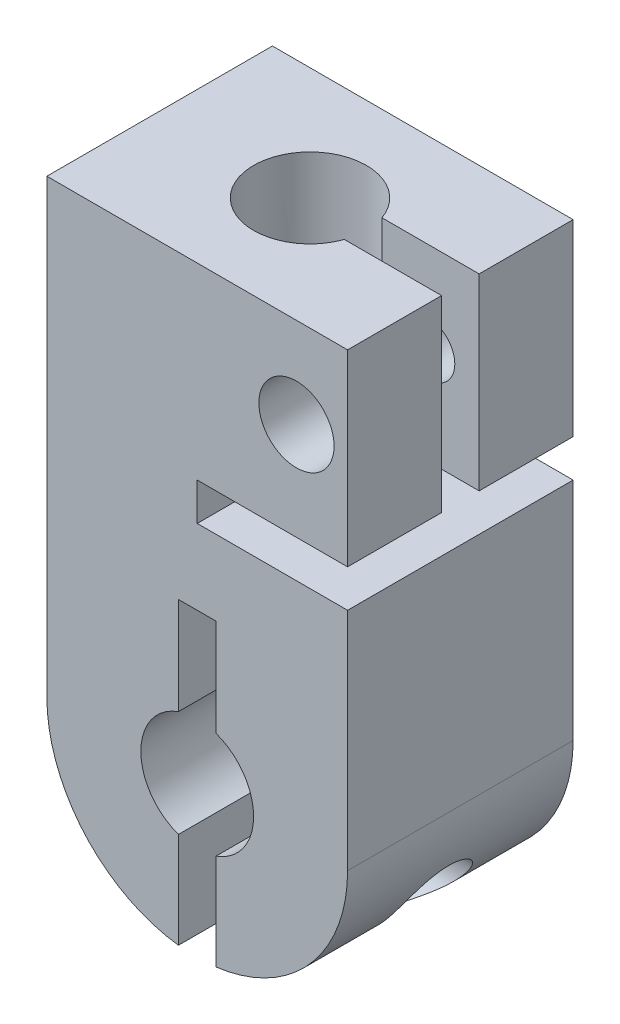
ISO-10303-21;
HEADER;
FILE_DESCRIPTION(('STEP AP214'),'2;1');
FILE_NAME('part.step','',(''),(''),'','','');
FILE_SCHEMA(('AUTOMOTIVE_DESIGN { 1 0 10303 214 1 1 1 1 }'));
ENDSEC;
DATA;
#1=APPLICATION_CONTEXT('core data for automotive mechanical design processes');
#2=APPLICATION_PROTOCOL_DEFINITION('international standard','automotive_design',2000,#1);
#3=PRODUCT_CONTEXT('',#1,'mechanical');
#4=PRODUCT('Part','Part','',(#3));
#5=PRODUCT_RELATED_PRODUCT_CATEGORY('part','',(#4));
#6=PRODUCT_DEFINITION_FORMATION('','',#4);
#7=PRODUCT_DEFINITION_CONTEXT('part definition',#1,'design');
#8=PRODUCT_DEFINITION('design','',#6,#7);
#9=PRODUCT_DEFINITION_SHAPE('','',#8);
#10=(LENGTH_UNIT() NAMED_UNIT(*) SI_UNIT(.MILLI.,.METRE.));
#11=(NAMED_UNIT(*) PLANE_ANGLE_UNIT() SI_UNIT($,.RADIAN.));
#12=(NAMED_UNIT(*) SI_UNIT($,.STERADIAN.) SOLID_ANGLE_UNIT());
#13=UNCERTAINTY_MEASURE_WITH_UNIT(LENGTH_MEASURE(1.E-05),#10,'distance_accuracy_value','');
#14=(GEOMETRIC_REPRESENTATION_CONTEXT(3) GLOBAL_UNCERTAINTY_ASSIGNED_CONTEXT((#13)) GLOBAL_UNIT_ASSIGNED_CONTEXT((#10,
#11,#12)) REPRESENTATION_CONTEXT('',''));
#15=CARTESIAN_POINT('',(0.,0.,0.));
#16=DIRECTION('',(0.,0.,1.));
#17=DIRECTION('',(1.,0.,0.));
#18=AXIS2_PLACEMENT_3D('',#15,#16,#17);
#19=CARTESIAN_POINT('',(6.35,19.05,9.525));
#20=DIRECTION('',(-1.,0.,0.));
#21=DIRECTION('',(0.,0.,1.));
#22=AXIS2_PLACEMENT_3D('',#19,#20,#21);
#23=PLANE('',#22);
#24=DIRECTION('',(0.,1.,0.));
#25=VECTOR('',#24,1.);
#26=CARTESIAN_POINT('',(6.35,9.525,3.96875));
#27=LINE('',#26,#25);
#28=CARTESIAN_POINT('',(6.35,11.1125,3.96875));
#29=VERTEX_POINT('',#28);
#30=CARTESIAN_POINT('',(6.35,19.05,3.96875));
#31=VERTEX_POINT('',#30);
#32=EDGE_CURVE('E56',#29,#31,#27,.T.);
#33=ORIENTED_EDGE('',*,*,#32,.F.);
#34=DIRECTION('',(0.,0.,-1.));
#35=VECTOR('',#34,1.);
#36=CARTESIAN_POINT('',(6.35,11.1125,9.525));
#37=LINE('',#36,#35);
#38=CARTESIAN_POINT('',(6.35,11.1125,0.));
#39=VERTEX_POINT('',#38);
#40=EDGE_CURVE('E398',#29,#39,#37,.T.);
#41=ORIENTED_EDGE('',*,*,#40,.T.);
#42=DIRECTION('',(0.,1.,0.));
#43=VECTOR('',#42,1.);
#44=CARTESIAN_POINT('',(6.35,19.05,0.));
#45=LINE('',#44,#43);
#46=CARTESIAN_POINT('',(6.35,19.05,0.));
#47=VERTEX_POINT('',#46);
#48=EDGE_CURVE('E222',#39,#47,#45,.T.);
#49=ORIENTED_EDGE('',*,*,#48,.T.);
#50=DIRECTION('',(0.,0.,-1.));
#51=VECTOR('',#50,1.);
#52=CARTESIAN_POINT('',(6.35,19.05,9.525));
#53=LINE('',#52,#51);
#54=EDGE_CURVE('E248',#31,#47,#53,.T.);
#55=ORIENTED_EDGE('',*,*,#54,.F.);
#56=EDGE_LOOP('',(#33,#41,#49,#55));
#57=FACE_BOUND('',#56,.T.);
#58=ADVANCED_FACE('F40',(#57),#23,.F.);
#59=DIRECTION('',(0.,1.,0.));
#60=VECTOR('',#59,1.);
#61=CARTESIAN_POINT('',(6.35,19.05,9.525));
#62=LINE('',#61,#60);
#63=CARTESIAN_POINT('',(6.35,11.1125,9.525));
#64=VERTEX_POINT('',#63);
#65=CARTESIAN_POINT('',(6.35,19.05,9.525));
#66=VERTEX_POINT('',#65);
#67=EDGE_CURVE('E235',#64,#66,#62,.T.);
#68=ORIENTED_EDGE('',*,*,#67,.F.);
#69=CARTESIAN_POINT('',(6.35,11.1125,5.55625));
#70=VERTEX_POINT('',#69);
#71=EDGE_CURVE('E376',#64,#70,#37,.T.);
#72=ORIENTED_EDGE('',*,*,#71,.T.);
#73=DIRECTION('',(0.,1.,0.));
#74=VECTOR('',#73,1.);
#75=CARTESIAN_POINT('',(6.35,9.525,5.55625));
#76=LINE('',#75,#74);
#77=CARTESIAN_POINT('',(6.35,19.05,5.55625));
#78=VERTEX_POINT('',#77);
#79=EDGE_CURVE('E423',#70,#78,#76,.T.);
#80=ORIENTED_EDGE('',*,*,#79,.T.);
#81=EDGE_CURVE('E249',#66,#78,#53,.T.);
#82=ORIENTED_EDGE('',*,*,#81,.F.);
#83=EDGE_LOOP('',(#68,#72,#80,#82));
#84=FACE_BOUND('',#83,.T.);
#85=ADVANCED_FACE('F358',(#84),#23,.F.);
#86=CARTESIAN_POINT('',(0.,0.,9.525));
#87=DIRECTION('',(0.,0.,-1.));
#88=DIRECTION('',(-1.,0.,0.));
#89=AXIS2_PLACEMENT_3D('',#86,#87,#88);
#90=CYLINDRICAL_SURFACE('',#89,6.35);
#91=CARTESIAN_POINT('',(-4.87918066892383,-4.064,3.63220000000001));
#92=CARTESIAN_POINT('',(-4.94061964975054,-3.99023319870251,3.63219971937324));
#93=CARTESIAN_POINT('',(-5.00044819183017,-3.91497650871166,3.63941180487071));
#94=CARTESIAN_POINT('',(-5.11515878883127,-3.76385774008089,3.67006060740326));
#95=CARTESIAN_POINT('',(-5.17004164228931,-3.68799576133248,3.69349469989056));
#96=CARTESIAN_POINT('',(-5.26010445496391,-3.55786831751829,3.7500251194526));
#97=CARTESIAN_POINT('',(-5.29677781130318,-3.50294962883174,3.77923533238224));
#98=CARTESIAN_POINT('',(-5.36549033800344,-3.39676325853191,3.84797038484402));
#99=CARTESIAN_POINT('',(-5.39753288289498,-3.34549293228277,3.88748765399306));
#100=CARTESIAN_POINT('',(-5.45641726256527,-3.24857762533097,3.97697838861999));
#101=CARTESIAN_POINT('',(-5.48321947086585,-3.20297638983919,4.02702599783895));
#102=CARTESIAN_POINT('',(-5.5305987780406,-3.12045682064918,4.13641200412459));
#103=CARTESIAN_POINT('',(-5.55117951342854,-3.08353341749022,4.19574494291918));
#104=CARTESIAN_POINT('',(-5.58342827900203,-3.02470096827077,4.3139055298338));
#105=CARTESIAN_POINT('',(-5.5958879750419,-3.00149335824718,4.37187248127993));
#106=CARTESIAN_POINT('',(-5.6153933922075,-2.96484304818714,4.49167239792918));
#107=CARTESIAN_POINT('',(-5.62244235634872,-2.95139449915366,4.55350302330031));
#108=CARTESIAN_POINT('',(-5.63063397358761,-2.93573333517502,4.67344734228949));
#109=CARTESIAN_POINT('',(-5.63223647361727,-2.93264621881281,4.73141738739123));
#110=CARTESIAN_POINT('',(-5.63080872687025,-2.93538691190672,4.84708131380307));
#111=CARTESIAN_POINT('',(-5.62777961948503,-2.94121252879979,4.9047752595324));
#112=CARTESIAN_POINT('',(-5.61726390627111,-2.96124427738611,5.01679972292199));
#113=CARTESIAN_POINT('',(-5.60988719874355,-2.97524371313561,5.0711778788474));
#114=CARTESIAN_POINT('',(-5.59087538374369,-3.01081655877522,5.17659910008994));
#115=CARTESIAN_POINT('',(-5.57924014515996,-3.0323902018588,5.22764206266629));
#116=CARTESIAN_POINT('',(-5.55154170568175,-3.08281181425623,5.32641506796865));
#117=CARTESIAN_POINT('',(-5.535373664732,-3.11183043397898,5.37402822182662));
#118=CARTESIAN_POINT('',(-5.49902099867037,-3.17562806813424,5.46349581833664));
#119=CARTESIAN_POINT('',(-5.47883543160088,-3.21040843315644,5.5053489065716));
#120=CARTESIAN_POINT('',(-5.43313987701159,-3.28719146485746,5.58557697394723));
#121=CARTESIAN_POINT('',(-5.40734440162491,-3.32953990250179,5.62345694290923));
#122=CARTESIAN_POINT('',(-5.35200401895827,-3.41778709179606,5.69153032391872));
#123=CARTESIAN_POINT('',(-5.32245764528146,-3.46368722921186,5.72172071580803));
#124=CARTESIAN_POINT('',(-5.25609651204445,-3.56370512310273,5.7778738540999));
#125=CARTESIAN_POINT('',(-5.21883602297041,-3.61811705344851,5.80278199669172));
#126=CARTESIAN_POINT('',(-5.14094396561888,-3.72796752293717,5.84328392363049));
#127=CARTESIAN_POINT('',(-5.10031018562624,-3.78340671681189,5.85887154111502));
#128=CARTESIAN_POINT('',(-5.00872183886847,-3.90409143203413,5.88341874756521));
#129=CARTESIAN_POINT('',(-4.95723596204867,-3.96928274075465,5.89065263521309));
#130=CARTESIAN_POINT('',(-4.85161566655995,-4.09771358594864,5.89412410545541));
#131=CARTESIAN_POINT('',(-4.79748072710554,-4.16095273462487,5.89035951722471));
#132=CARTESIAN_POINT('',(-4.67605008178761,-4.29732758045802,5.87102076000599));
#133=CARTESIAN_POINT('',(-4.60835918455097,-4.36978551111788,5.85315290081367));
#134=CARTESIAN_POINT('',(-4.47189588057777,-4.50934552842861,5.80400905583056));
#135=CARTESIAN_POINT('',(-4.40312085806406,-4.5764310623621,5.772693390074));
#136=CARTESIAN_POINT('',(-4.29535937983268,-4.67710684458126,5.71303476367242));
#137=CARTESIAN_POINT('',(-4.25601454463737,-4.71291414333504,5.68898476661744));
#138=CARTESIAN_POINT('',(-4.17810191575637,-4.78212032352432,5.63643994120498));
#139=CARTESIAN_POINT('',(-4.13953458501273,-4.81551779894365,5.60794254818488));
#140=CARTESIAN_POINT('',(-4.06398051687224,-4.87944687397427,5.54645430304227));
#141=CARTESIAN_POINT('',(-4.026987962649,-4.90998963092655,5.51348229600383));
#142=CARTESIAN_POINT('',(-3.95531889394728,-4.96790373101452,5.44266605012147));
#143=CARTESIAN_POINT('',(-3.92063915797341,-4.99527952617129,5.40482881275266));
#144=CARTESIAN_POINT('',(-3.8592817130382,-5.04279111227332,5.32929664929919));
#145=CARTESIAN_POINT('',(-3.83215582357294,-5.06340537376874,5.29227250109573));
#146=CARTESIAN_POINT('',(-3.7818112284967,-5.10111654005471,5.21399752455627));
#147=CARTESIAN_POINT('',(-3.75858787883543,-5.11821763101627,5.1727518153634));
#148=CARTESIAN_POINT('',(-3.72086570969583,-5.14568941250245,5.09269646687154));
#149=CARTESIAN_POINT('',(-3.70557489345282,-5.156690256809,5.05448457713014));
#150=CARTESIAN_POINT('',(-3.68025293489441,-5.17479304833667,4.97546462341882));
#151=CARTESIAN_POINT('',(-3.67021597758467,-5.18189930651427,4.93465948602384));
#152=CARTESIAN_POINT('',(-3.65645953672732,-5.19161629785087,4.85105509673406));
#153=CARTESIAN_POINT('',(-3.65279678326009,-5.19418666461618,4.80824138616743));
#154=CARTESIAN_POINT('',(-3.65248526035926,-5.19440584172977,4.72257934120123));
#155=CARTESIAN_POINT('',(-3.65583491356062,-5.19205575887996,4.67973101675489));
#156=CARTESIAN_POINT('',(-3.66815819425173,-5.18335401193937,4.60135749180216));
#157=CARTESIAN_POINT('',(-3.67630568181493,-5.17758955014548,4.56562842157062));
#158=CARTESIAN_POINT('',(-3.69674076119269,-5.16301904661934,4.49604063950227));
#159=CARTESIAN_POINT('',(-3.70903038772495,-5.15421151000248,4.46218285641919));
#160=CARTESIAN_POINT('',(-3.74458191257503,-5.12848007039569,4.37873338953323));
#161=CARTESIAN_POINT('',(-3.77016550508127,-5.10975363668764,4.33069131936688));
#162=CARTESIAN_POINT('',(-3.82665035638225,-5.06759320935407,4.24011272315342));
#163=CARTESIAN_POINT('',(-3.85756657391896,-5.04414594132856,4.19759229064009));
#164=CARTESIAN_POINT('',(-3.94140679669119,-4.97915392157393,4.09497829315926));
#165=CARTESIAN_POINT('',(-3.99683992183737,-4.93490551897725,4.03866106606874));
#166=CARTESIAN_POINT('',(-4.11186542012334,-4.83949461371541,3.93724921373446));
#167=CARTESIAN_POINT('',(-4.17146797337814,-4.78831488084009,3.89218337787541));
#168=CARTESIAN_POINT('',(-4.31021917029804,-4.66427941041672,3.80083557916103));
#169=CARTESIAN_POINT('',(-4.38996341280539,-4.58947423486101,3.75808999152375));
#170=CARTESIAN_POINT('',(-4.54885817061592,-4.43202613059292,3.69038174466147));
#171=CARTESIAN_POINT('',(-4.62800972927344,-4.34940608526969,3.66536888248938));
#172=CARTESIAN_POINT('',(-4.73504274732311,-4.23128936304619,3.64416223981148));
#173=CARTESIAN_POINT('',(-4.76426427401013,-4.19836075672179,3.63971658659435));
#174=CARTESIAN_POINT('',(-4.82216522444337,-4.13172744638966,3.63373445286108));
#175=CARTESIAN_POINT('',(-4.85084423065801,-4.09802218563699,3.63220012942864));
#176=CARTESIAN_POINT('',(-4.87918066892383,-4.064,3.63220000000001));
#177=B_SPLINE_CURVE_WITH_KNOTS('',3,(#91,#92,#93,#94,#95,#96,#97,#98,#99,#100,#101,#102,#103,
#104,#105,#106,#107,#108,#109,#110,#111,#112,#113,#114,#115,#116,#117,#118,#119,#120,#121,#122,
#123,#124,#125,#126,#127,#128,#129,#130,#131,#132,#133,#134,#135,#136,#137,#138,#139,#140,#141,
#142,#143,#144,#145,#146,#147,#148,#149,#150,#151,#152,#153,#154,#155,#156,#157,#158,#159,#160,
#161,#162,#163,#164,#165,#166,#167,#168,#169,#170,#171,#172,#173,#174,#175,#176),.UNSPECIFIED.,
.T.,.F.,(4,2,2,2,2,2,2,2,2,2,2,2,2,2,2,2,2,2,2,2,2,2,2,2,2,2,2,2,2,2,2,2,2,2,2,2,2,2,2,2,2,2,4),
(0.,0.287847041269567,0.575647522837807,0.791418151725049,1.0070307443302,1.22421554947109,
1.44127316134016,1.63124738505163,1.82110765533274,1.99447638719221,2.16780247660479,
2.33692455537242,2.50605184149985,2.67946951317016,2.85292789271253,3.03937302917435,
3.22589128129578,3.43657639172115,3.64740074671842,3.89664783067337,4.14594411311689,
4.44709812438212,4.74914691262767,4.92410997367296,5.09917430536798,5.27352298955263,
5.44762352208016,5.59821346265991,5.74862291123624,5.87594679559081,6.00312945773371,
6.13143835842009,6.2597184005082,6.37056562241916,6.48146737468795,6.65316488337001,
6.82535210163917,7.09556407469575,7.36646052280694,7.7169855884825,8.06651427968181,
8.19917473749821,8.33193344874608),.UNSPECIFIED.);
#178=CARTESIAN_POINT('',(-4.87918066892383,-4.064,3.63220000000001));
#179=VERTEX_POINT('',#178);
#180=EDGE_CURVE('E309',#179,#179,#177,.T.);
#181=ORIENTED_EDGE('',*,*,#180,.T.);
#182=EDGE_LOOP('',(#181));
#183=FACE_BOUND('',#182,.T.);
#184=CARTESIAN_POINT('',(0.,0.,0.));
#185=DIRECTION('',(0.,0.,1.));
#186=DIRECTION('',(1.,0.,0.));
#187=AXIS2_PLACEMENT_3D('',#184,#185,#186);
#188=CIRCLE('',#187,6.35);
#189=CARTESIAN_POINT('',(-6.35,0.,0.));
#190=VERTEX_POINT('',#189);
#191=CARTESIAN_POINT('',(-0.793750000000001,-6.30019530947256,0.));
#192=VERTEX_POINT('',#191);
#193=EDGE_CURVE('E226',#190,#192,#188,.T.);
#194=ORIENTED_EDGE('',*,*,#193,.T.);
#195=DIRECTION('',(0.,0.,-1.));
#196=VECTOR('',#195,1.);
#197=CARTESIAN_POINT('',(-0.793750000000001,-6.30019530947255,9.525));
#198=LINE('',#197,#196);
#199=CARTESIAN_POINT('',(-0.793750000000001,-6.30019530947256,9.525));
#200=VERTEX_POINT('',#199);
#201=EDGE_CURVE('E286',#192,#200,#198,.F.);
#202=ORIENTED_EDGE('',*,*,#201,.T.);
#203=CARTESIAN_POINT('',(0.,0.,9.525));
#204=DIRECTION('',(0.,0.,1.));
#205=DIRECTION('',(1.,0.,0.));
#206=AXIS2_PLACEMENT_3D('',#203,#204,#205);
#207=CIRCLE('',#206,6.35);
#208=CARTESIAN_POINT('',(-6.35,0.,9.525));
#209=VERTEX_POINT('',#208);
#210=EDGE_CURVE('E232',#209,#200,#207,.T.);
#211=ORIENTED_EDGE('',*,*,#210,.F.);
#212=DIRECTION('',(0.,0.,-1.));
#213=VECTOR('',#212,1.);
#214=CARTESIAN_POINT('',(-6.35,0.,9.525));
#215=LINE('',#214,#213);
#216=EDGE_CURVE('E242',#209,#190,#215,.T.);
#217=ORIENTED_EDGE('',*,*,#216,.T.);
#218=EDGE_LOOP('',(#194,#202,#211,#217));
#219=FACE_BOUND('',#218,.T.);
#220=ADVANCED_FACE('F365',(#183,#219),#90,.T.);
#221=CARTESIAN_POINT('',(0.,0.,9.525));
#222=DIRECTION('',(0.,0.,-1.));
#223=DIRECTION('',(-1.,0.,0.));
#224=AXIS2_PLACEMENT_3D('',#221,#222,#223);
#225=CYLINDRICAL_SURFACE('',#224,2.38125);
#226=DIRECTION('',(0.,0.,-1.));
#227=VECTOR('',#226,1.);
#228=CARTESIAN_POINT('',(-0.793750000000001,2.24506403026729,9.525));
#229=LINE('',#228,#227);
#230=CARTESIAN_POINT('',(-0.793750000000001,2.24506403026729,9.525));
#231=VERTEX_POINT('',#230);
#232=CARTESIAN_POINT('',(-0.793750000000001,2.24506403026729,0.));
#233=VERTEX_POINT('',#232);
#234=EDGE_CURVE('E50',#231,#233,#229,.T.);
#235=ORIENTED_EDGE('',*,*,#234,.F.);
#236=CARTESIAN_POINT('',(0.,0.,9.525));
#237=DIRECTION('',(0.,0.,1.));
#238=DIRECTION('',(1.,0.,0.));
#239=AXIS2_PLACEMENT_3D('',#236,#237,#238);
#240=CIRCLE('',#239,2.38125);
#241=CARTESIAN_POINT('',(-0.793750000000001,-2.24506403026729,9.525));
#242=VERTEX_POINT('',#241);
#243=EDGE_CURVE('E284',#231,#242,#240,.T.);
#244=ORIENTED_EDGE('',*,*,#243,.T.);
#245=DIRECTION('',(0.,0.,-1.));
#246=VECTOR('',#245,1.);
#247=CARTESIAN_POINT('',(-0.793750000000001,-2.24506403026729,9.525));
#248=LINE('',#247,#246);
#249=CARTESIAN_POINT('',(-0.793750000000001,-2.24506403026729,0.));
#250=VERTEX_POINT('',#249);
#251=EDGE_CURVE('E257',#250,#242,#248,.F.);
#252=ORIENTED_EDGE('',*,*,#251,.F.);
#253=CARTESIAN_POINT('',(0.,0.,0.));
#254=DIRECTION('',(0.,0.,1.));
#255=DIRECTION('',(1.,0.,0.));
#256=AXIS2_PLACEMENT_3D('',#253,#254,#255);
#257=CIRCLE('',#256,2.38125);
#258=EDGE_CURVE('E273',#233,#250,#257,.T.);
#259=ORIENTED_EDGE('',*,*,#258,.F.);
#260=EDGE_LOOP('',(#235,#244,#252,#259));
#261=FACE_BOUND('',#260,.T.);
#262=ADVANCED_FACE('F279',(#261),#225,.F.);
#263=CARTESIAN_POINT('',(0.,0.,9.525));
#264=DIRECTION('',(0.,0.,1.));
#265=DIRECTION('',(1.,0.,0.));
#266=AXIS2_PLACEMENT_3D('',#263,#264,#265);
#267=PLANE('',#266);
#268=CARTESIAN_POINT('',(4.191,15.24,9.525));
#269=DIRECTION('',(0.,0.,1.));
#270=DIRECTION('',(1.,0.,0.));
#271=AXIS2_PLACEMENT_3D('',#268,#269,#270);
#272=CIRCLE('',#271,1.5875);
#273=CARTESIAN_POINT('',(5.7785,15.24,9.525));
#274=VERTEX_POINT('',#273);
#275=EDGE_CURVE('E479',#274,#274,#272,.T.);
#276=ORIENTED_EDGE('',*,*,#275,.F.);
#277=EDGE_LOOP('',(#276));
#278=FACE_BOUND('',#277,.T.);
#279=DIRECTION('',(1.,0.,0.));
#280=VECTOR('',#279,1.);
#281=CARTESIAN_POINT('',(6.35,11.1125,9.525));
#282=LINE('',#281,#280);
#283=CARTESIAN_POINT('',(0.,11.1125,9.525));
#284=VERTEX_POINT('',#283);
#285=EDGE_CURVE('E384',#284,#64,#282,.T.);
#286=ORIENTED_EDGE('',*,*,#285,.T.);
#287=ORIENTED_EDGE('',*,*,#67,.T.);
#288=DIRECTION('',(-1.,0.,0.));
#289=VECTOR('',#288,1.);
#290=CARTESIAN_POINT('',(-6.35,19.05,9.525));
#291=LINE('',#290,#289);
#292=CARTESIAN_POINT('',(-6.35,19.05,9.525));
#293=VERTEX_POINT('',#292);
#294=EDGE_CURVE('E238',#66,#293,#291,.T.);
#295=ORIENTED_EDGE('',*,*,#294,.T.);
#296=DIRECTION('',(0.,-1.,0.));
#297=VECTOR('',#296,1.);
#298=CARTESIAN_POINT('',(-6.35,0.,9.525));
#299=LINE('',#298,#297);
#300=EDGE_CURVE('E240',#293,#209,#299,.T.);
#301=ORIENTED_EDGE('',*,*,#300,.T.);
#302=ORIENTED_EDGE('',*,*,#210,.T.);
#303=DIRECTION('',(0.,-1.,0.));
#304=VECTOR('',#303,1.);
#305=CARTESIAN_POINT('',(-0.793750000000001,6.35,9.525));
#306=LINE('',#305,#304);
#307=EDGE_CURVE('E308',#242,#200,#306,.T.);
#308=ORIENTED_EDGE('',*,*,#307,.F.);
#309=ORIENTED_EDGE('',*,*,#243,.F.);
#310=CARTESIAN_POINT('',(-0.793750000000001,6.35,9.525));
#311=VERTEX_POINT('',#310);
#312=EDGE_CURVE('E267',#311,#231,#306,.T.);
#313=ORIENTED_EDGE('',*,*,#312,.F.);
#314=DIRECTION('',(-1.,0.,0.));
#315=VECTOR('',#314,1.);
#316=CARTESIAN_POINT('',(-0.793750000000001,6.35,9.525));
#317=LINE('',#316,#315);
#318=CARTESIAN_POINT('',(0.793749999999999,6.35,9.525));
#319=VERTEX_POINT('',#318);
#320=EDGE_CURVE('E301',#319,#311,#317,.T.);
#321=ORIENTED_EDGE('',*,*,#320,.F.);
#322=DIRECTION('',(0.,1.,0.));
#323=VECTOR('',#322,1.);
#324=CARTESIAN_POINT('',(0.793749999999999,6.35,9.525));
#325=LINE('',#324,#323);
#326=CARTESIAN_POINT('',(0.79375,2.24506403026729,9.525));
#327=VERTEX_POINT('',#326);
#328=EDGE_CURVE('E305',#327,#319,#325,.T.);
#329=ORIENTED_EDGE('',*,*,#328,.F.);
#330=CARTESIAN_POINT('',(0.79375,-2.24506403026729,9.525));
#331=VERTEX_POINT('',#330);
#332=EDGE_CURVE('E280',#331,#327,#240,.T.);
#333=ORIENTED_EDGE('',*,*,#332,.F.);
#334=CARTESIAN_POINT('',(0.79375,-6.30019530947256,9.525));
#335=VERTEX_POINT('',#334);
#336=EDGE_CURVE('E304',#335,#331,#325,.T.);
#337=ORIENTED_EDGE('',*,*,#336,.F.);
#338=CARTESIAN_POINT('',(6.35,0.,9.525));
#339=VERTEX_POINT('',#338);
#340=EDGE_CURVE('E231',#335,#339,#207,.T.);
#341=ORIENTED_EDGE('',*,*,#340,.T.);
#342=CARTESIAN_POINT('',(6.35,9.525,9.525));
#343=VERTEX_POINT('',#342);
#344=EDGE_CURVE('E236',#339,#343,#62,.T.);
#345=ORIENTED_EDGE('',*,*,#344,.T.);
#346=DIRECTION('',(-1.,0.,0.));
#347=VECTOR('',#346,1.);
#348=CARTESIAN_POINT('',(6.35,9.525,9.525));
#349=LINE('',#348,#347);
#350=CARTESIAN_POINT('',(0.,9.525,9.525));
#351=VERTEX_POINT('',#350);
#352=EDGE_CURVE('E199',#343,#351,#349,.T.);
#353=ORIENTED_EDGE('',*,*,#352,.T.);
#354=DIRECTION('',(0.,1.,0.));
#355=VECTOR('',#354,1.);
#356=CARTESIAN_POINT('',(0.,9.525,9.525));
#357=LINE('',#356,#355);
#358=EDGE_CURVE('E386',#351,#284,#357,.T.);
#359=ORIENTED_EDGE('',*,*,#358,.T.);
#360=EDGE_LOOP('',(#286,#287,#295,#301,#302,#308,#309,#313,#321,#329,#333,#337,#341,#345,#353,#359));
#361=FACE_BOUND('',#360,.T.);
#362=ADVANCED_FACE('F346',(#278,#361),#267,.T.);
#363=CARTESIAN_POINT('',(0.,0.,0.));
#364=DIRECTION('',(0.,0.,1.));
#365=DIRECTION('',(1.,0.,0.));
#366=AXIS2_PLACEMENT_3D('',#363,#364,#365);
#367=PLANE('',#366);
#368=CARTESIAN_POINT('',(4.191,15.24,0.));
#369=DIRECTION('',(0.,0.,1.));
#370=DIRECTION('',(1.,0.,0.));
#371=AXIS2_PLACEMENT_3D('',#368,#369,#370);
#372=CIRCLE('',#371,1.1303);
#373=CARTESIAN_POINT('',(5.3213,15.24,0.));
#374=VERTEX_POINT('',#373);
#375=EDGE_CURVE('E473',#374,#374,#372,.T.);
#376=ORIENTED_EDGE('',*,*,#375,.T.);
#377=EDGE_LOOP('',(#376));
#378=FACE_BOUND('',#377,.T.);
#379=ORIENTED_EDGE('',*,*,#48,.F.);
#380=DIRECTION('',(1.,0.,0.));
#381=VECTOR('',#380,1.);
#382=CARTESIAN_POINT('',(6.35,11.1125,0.));
#383=LINE('',#382,#381);
#384=CARTESIAN_POINT('',(0.,11.1125,0.));
#385=VERTEX_POINT('',#384);
#386=EDGE_CURVE('E459',#385,#39,#383,.T.);
#387=ORIENTED_EDGE('',*,*,#386,.F.);
#388=DIRECTION('',(0.,1.,0.));
#389=VECTOR('',#388,1.);
#390=CARTESIAN_POINT('',(0.,9.525,0.));
#391=LINE('',#390,#389);
#392=CARTESIAN_POINT('',(0.,9.525,0.));
#393=VERTEX_POINT('',#392);
#394=EDGE_CURVE('E216',#393,#385,#391,.T.);
#395=ORIENTED_EDGE('',*,*,#394,.F.);
#396=DIRECTION('',(-1.,0.,0.));
#397=VECTOR('',#396,1.);
#398=CARTESIAN_POINT('',(6.35,9.525,0.));
#399=LINE('',#398,#397);
#400=CARTESIAN_POINT('',(6.35,9.525,0.));
#401=VERTEX_POINT('',#400);
#402=EDGE_CURVE('E196',#401,#393,#399,.T.);
#403=ORIENTED_EDGE('',*,*,#402,.F.);
#404=CARTESIAN_POINT('',(6.35,0.,0.));
#405=VERTEX_POINT('',#404);
#406=EDGE_CURVE('E212',#405,#401,#45,.T.);
#407=ORIENTED_EDGE('',*,*,#406,.F.);
#408=CARTESIAN_POINT('',(0.79375,-6.30019530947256,0.));
#409=VERTEX_POINT('',#408);
#410=EDGE_CURVE('E447',#409,#405,#188,.T.);
#411=ORIENTED_EDGE('',*,*,#410,.F.);
#412=DIRECTION('',(0.,1.,0.));
#413=VECTOR('',#412,1.);
#414=CARTESIAN_POINT('',(0.793749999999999,6.35,0.));
#415=LINE('',#414,#413);
#416=CARTESIAN_POINT('',(0.79375,-2.24506403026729,0.));
#417=VERTEX_POINT('',#416);
#418=EDGE_CURVE('E299',#409,#417,#415,.T.);
#419=ORIENTED_EDGE('',*,*,#418,.T.);
#420=CARTESIAN_POINT('',(0.79375,2.24506403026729,0.));
#421=VERTEX_POINT('',#420);
#422=EDGE_CURVE('E281',#417,#421,#257,.T.);
#423=ORIENTED_EDGE('',*,*,#422,.T.);
#424=CARTESIAN_POINT('',(0.793749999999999,6.35,0.));
#425=VERTEX_POINT('',#424);
#426=EDGE_CURVE('E277',#421,#425,#415,.T.);
#427=ORIENTED_EDGE('',*,*,#426,.T.);
#428=DIRECTION('',(-1.,0.,0.));
#429=VECTOR('',#428,1.);
#430=CARTESIAN_POINT('',(-0.793750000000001,6.35,0.));
#431=LINE('',#430,#429);
#432=CARTESIAN_POINT('',(-0.793750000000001,6.35,0.));
#433=VERTEX_POINT('',#432);
#434=EDGE_CURVE('E276',#425,#433,#431,.T.);
#435=ORIENTED_EDGE('',*,*,#434,.T.);
#436=DIRECTION('',(0.,-1.,0.));
#437=VECTOR('',#436,1.);
#438=CARTESIAN_POINT('',(-0.793750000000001,6.35,0.));
#439=LINE('',#438,#437);
#440=EDGE_CURVE('E264',#433,#233,#439,.T.);
#441=ORIENTED_EDGE('',*,*,#440,.T.);
#442=ORIENTED_EDGE('',*,*,#258,.T.);
#443=EDGE_CURVE('E64',#250,#192,#439,.T.);
#444=ORIENTED_EDGE('',*,*,#443,.T.);
#445=ORIENTED_EDGE('',*,*,#193,.F.);
#446=DIRECTION('',(0.,-1.,0.));
#447=VECTOR('',#446,1.);
#448=CARTESIAN_POINT('',(-6.35,0.,0.));
#449=LINE('',#448,#447);
#450=CARTESIAN_POINT('',(-6.35,19.05,0.));
#451=VERTEX_POINT('',#450);
#452=EDGE_CURVE('E224',#451,#190,#449,.T.);
#453=ORIENTED_EDGE('',*,*,#452,.F.);
#454=DIRECTION('',(-1.,0.,0.));
#455=VECTOR('',#454,1.);
#456=CARTESIAN_POINT('',(-6.35,19.05,0.));
#457=LINE('',#456,#455);
#458=EDGE_CURVE('E221',#47,#451,#457,.T.);
#459=ORIENTED_EDGE('',*,*,#458,.F.);
#460=EDGE_LOOP('',(#379,#387,#395,#403,#407,#411,#419,#423,#427,#435,#441,#442,#444,#445,#453,#459));
#461=FACE_BOUND('',#460,.T.);
#462=ADVANCED_FACE('F210',(#378,#461),#367,.F.);
#463=CARTESIAN_POINT('',(4.87918066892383,-4.064,6.39444999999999));
#464=CARTESIAN_POINT('',(4.96825384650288,-3.95705720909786,6.39444975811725));
#465=CARTESIAN_POINT('',(5.05383740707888,-3.8471027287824,6.38395977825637));
#466=CARTESIAN_POINT('',(5.21530580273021,-3.6251591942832,6.33839085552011));
#467=CARTESIAN_POINT('',(5.29121104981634,-3.51317501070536,6.30336470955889));
#468=CARTESIAN_POINT('',(5.41040440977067,-3.32544999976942,6.22026268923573));
#469=CARTESIAN_POINT('',(5.45675685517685,-3.24864409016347,6.17894894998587));
#470=CARTESIAN_POINT('',(5.54250890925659,-3.10006858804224,6.0823222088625));
#471=CARTESIAN_POINT('',(5.58191206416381,-3.02829643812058,6.02701638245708));
#472=CARTESIAN_POINT('',(5.65336943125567,-2.89272121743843,5.90261921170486));
#473=CARTESIAN_POINT('',(5.68538510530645,-2.82896069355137,5.83345894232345));
#474=CARTESIAN_POINT('',(5.74154343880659,-2.71317824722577,5.6831147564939));
#475=CARTESIAN_POINT('',(5.76568803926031,-2.66115343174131,5.60193381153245));
#476=CARTESIAN_POINT('',(5.80430161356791,-2.57576903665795,5.43792224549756));
#477=CARTESIAN_POINT('',(5.81944876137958,-2.54114586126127,5.35590667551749));
#478=CARTESIAN_POINT('',(5.84340170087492,-2.48557465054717,5.18649626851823));
#479=CARTESIAN_POINT('',(5.85220942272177,-2.46462245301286,5.09910307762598));
#480=CARTESIAN_POINT('',(5.86335412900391,-2.43798615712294,4.92580735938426));
#481=CARTESIAN_POINT('',(5.86597271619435,-2.43163796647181,4.84002419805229));
#482=CARTESIAN_POINT('',(5.8656140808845,-2.43250340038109,4.66854310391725));
#483=CARTESIAN_POINT('',(5.86263756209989,-2.43971531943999,4.58284516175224));
#484=CARTESIAN_POINT('',(5.85110321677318,-2.46724678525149,4.41493674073));
#485=CARTESIAN_POINT('',(5.84260638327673,-2.48742306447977,4.33269848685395));
#486=CARTESIAN_POINT('',(5.81997841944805,-2.53991377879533,4.17302176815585));
#487=CARTESIAN_POINT('',(5.805847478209,-2.57222780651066,4.09558314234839));
#488=CARTESIAN_POINT('',(5.77167945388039,-2.64800878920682,3.94686642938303));
#489=CARTESIAN_POINT('',(5.75158934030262,-2.69157541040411,3.8756514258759));
#490=CARTESIAN_POINT('',(5.70551851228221,-2.78790263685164,3.74189616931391));
#491=CARTESIAN_POINT('',(5.67953732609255,-2.84066397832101,3.67935661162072));
#492=CARTESIAN_POINT('',(5.62070384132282,-2.95541697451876,3.56196082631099));
#493=CARTESIAN_POINT('',(5.58762874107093,-3.01768235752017,3.50748488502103));
#494=CARTESIAN_POINT('',(5.51559782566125,-3.14740967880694,3.40982733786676));
#495=CARTESIAN_POINT('',(5.47664051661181,-3.21487293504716,3.36664860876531));
#496=CARTESIAN_POINT('',(5.3896368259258,-3.35886768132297,3.28826948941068));
#497=CARTESIAN_POINT('',(5.34108907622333,-3.43567044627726,3.25412869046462));
#498=CARTESIAN_POINT('',(5.2384817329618,-3.59018761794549,3.19868538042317));
#499=CARTESIAN_POINT('',(5.18441853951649,-3.66790259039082,3.17739131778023));
#500=CARTESIAN_POINT('',(5.04725680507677,-3.85569179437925,3.13997849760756));
#501=CARTESIAN_POINT('',(4.96170934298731,-3.96523218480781,3.13007593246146));
#502=CARTESIAN_POINT('',(4.78364480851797,-4.17835872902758,3.13106128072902));
#503=CARTESIAN_POINT('',(4.69111522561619,-4.28193357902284,3.1419874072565));
#504=CARTESIAN_POINT('',(4.47394352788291,-4.50972224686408,3.18716180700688));
#505=CARTESIAN_POINT('',(4.34772130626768,-4.63130110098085,3.22721539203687));
#506=CARTESIAN_POINT('',(4.15575471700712,-4.80204533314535,3.30562565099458));
#507=CARTESIAN_POINT('',(4.09122460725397,-4.85709922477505,3.3348771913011));
#508=CARTESIAN_POINT('',(3.9617956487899,-4.96322993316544,3.39923312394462));
#509=CARTESIAN_POINT('',(3.89689690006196,-5.01430777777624,3.43433599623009));
#510=CARTESIAN_POINT('',(3.77663366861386,-5.1053296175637,3.5048368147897));
#511=CARTESIAN_POINT('',(3.72123368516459,-5.14582096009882,3.53947384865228));
#512=CARTESIAN_POINT('',(3.61110710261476,-5.22369101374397,3.61304490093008));
#513=CARTESIAN_POINT('',(3.55638038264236,-5.26107029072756,3.65197813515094));
#514=CARTESIAN_POINT('',(3.44845847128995,-5.33242925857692,3.73424763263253));
#515=CARTESIAN_POINT('',(3.39525801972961,-5.36642197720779,3.77756561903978));
#516=CARTESIAN_POINT('',(3.29113322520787,-5.43090047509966,3.86920094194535));
#517=CARTESIAN_POINT('',(3.24020675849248,-5.46138957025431,3.91751346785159));
#518=CARTESIAN_POINT('',(3.15144065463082,-5.51298780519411,4.01020618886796));
#519=CARTESIAN_POINT('',(3.11295602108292,-5.5347774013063,4.05358242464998));
#520=CARTESIAN_POINT('',(3.03965827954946,-5.57536828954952,4.14482408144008));
#521=CARTESIAN_POINT('',(3.0048509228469,-5.5941649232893,4.19269631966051));
#522=CARTESIAN_POINT('',(2.94052971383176,-5.62824342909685,4.29418958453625));
#523=CARTESIAN_POINT('',(2.91109846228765,-5.64347133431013,4.34788288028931));
#524=CARTESIAN_POINT('',(2.86149936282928,-5.66878371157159,4.46048376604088));
#525=CARTESIAN_POINT('',(2.84129024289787,-5.67889112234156,4.51936668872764));
#526=CARTESIAN_POINT('',(2.81839145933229,-5.690278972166,4.6205758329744));
#527=CARTESIAN_POINT('',(2.81210748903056,-5.69337866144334,4.66187871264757));
#528=CARTESIAN_POINT('',(2.80601151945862,-5.6963859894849,4.74507647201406));
#529=CARTESIAN_POINT('',(2.80619565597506,-5.69629553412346,4.78697098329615));
#530=CARTESIAN_POINT('',(2.81300590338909,-5.69293507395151,4.87000676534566));
#531=CARTESIAN_POINT('',(2.81962056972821,-5.68967071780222,4.91114924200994));
#532=CARTESIAN_POINT('',(2.83849882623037,-5.68027584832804,4.99177361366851));
#533=CARTESIAN_POINT('',(2.85076876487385,-5.67414211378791,5.03125358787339));
#534=CARTESIAN_POINT('',(2.88738211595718,-5.65562795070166,5.12787778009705));
#535=CARTESIAN_POINT('',(2.91468730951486,-5.64165755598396,5.18358013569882));
#536=CARTESIAN_POINT('',(2.97619772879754,-5.60945232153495,5.28969620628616));
#537=CARTESIAN_POINT('',(3.01042430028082,-5.59120426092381,5.3400928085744));
#538=CARTESIAN_POINT('',(3.08009263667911,-5.55310441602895,5.43188223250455));
#539=CARTESIAN_POINT('',(3.1151669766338,-5.53353203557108,5.47367701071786));
#540=CARTESIAN_POINT('',(3.18782311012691,-5.49199815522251,5.55377498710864));
#541=CARTESIAN_POINT('',(3.22540696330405,-5.47003468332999,5.59207525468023));
#542=CARTESIAN_POINT('',(3.34081760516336,-5.40087466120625,5.70250528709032));
#543=CARTESIAN_POINT('',(3.42117591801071,-5.3504768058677,5.7700081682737));
#544=CARTESIAN_POINT('',(3.56892922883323,-5.25276626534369,5.88254457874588));
#545=CARTESIAN_POINT('',(3.6358311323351,-5.20673699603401,5.929399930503));
#546=CARTESIAN_POINT('',(3.77050309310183,-5.11005578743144,6.0168041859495));
#547=CARTESIAN_POINT('',(3.83827363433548,-5.05940116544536,6.0573493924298));
#548=CARTESIAN_POINT('',(3.97372391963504,-4.95372493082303,6.13210980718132));
#549=CARTESIAN_POINT('',(4.0414036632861,-4.89870928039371,6.16633345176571));
#550=CARTESIAN_POINT('',(4.17611406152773,-4.78438952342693,6.2282851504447));
#551=CARTESIAN_POINT('',(4.24314464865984,-4.72508497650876,6.25601253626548));
#552=CARTESIAN_POINT('',(4.40861215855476,-4.57217551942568,6.31643352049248));
#553=CARTESIAN_POINT('',(4.50631183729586,-4.47602490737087,6.34488230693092));
#554=CARTESIAN_POINT('',(4.69690491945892,-4.27559216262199,6.38388812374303));
#555=CARTESIAN_POINT('',(4.78979968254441,-4.17131235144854,6.39445024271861));
#556=CARTESIAN_POINT('',(4.87918066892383,-4.064,6.39444999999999));
#557=B_SPLINE_CURVE_WITH_KNOTS('',3,(#463,#464,#465,#466,#467,#468,#469,#470,#471,#472,#473,
#474,#475,#476,#477,#478,#479,#480,#481,#482,#483,#484,#485,#486,#487,#488,#489,#490,#491,#492,
#493,#494,#495,#496,#497,#498,#499,#500,#501,#502,#503,#504,#505,#506,#507,#508,#509,#510,#511,
#512,#513,#514,#515,#516,#517,#518,#519,#520,#521,#522,#523,#524,#525,#526,#527,#528,#529,#530,
#531,#532,#533,#534,#535,#536,#537,#538,#539,#540,#541,#542,#543,#544,#545,#546,#547,#548,#549,
#550,#551,#552,#553,#554,#555,#556),.UNSPECIFIED.,.T.,.F.,(4,2,2,2,2,2,2,2,2,2,2,2,2,2,2,2,2,2,
2,2,2,2,2,2,2,2,2,2,2,2,2,2,2,2,2,2,2,2,2,2,2,2,2,2,2,2,4),(0.,0.41707781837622,
0.833260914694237,1.12835196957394,1.42329200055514,1.71973750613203,2.01610985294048,
2.28564485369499,2.55509775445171,2.81203263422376,3.06893520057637,3.32304648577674,
3.57714924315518,3.8335847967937,4.09004089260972,4.35620130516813,4.62242942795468,
4.91247916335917,5.20271943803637,5.61842324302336,6.03489044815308,6.57117281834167,
6.84015155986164,7.10906053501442,7.33949216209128,7.56988179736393,7.79934783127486,
8.02859487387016,8.21417360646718,8.4000384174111,8.58855476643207,8.77621896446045,
8.90133094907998,9.02636818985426,9.15118330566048,9.27613887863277,9.46581345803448,
9.65608217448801,9.82972752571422,10.00351718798,10.3517287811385,10.6327018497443,
10.9138389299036,11.194598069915,11.4753860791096,11.8940243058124,12.3125434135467),.UNSPECIFIED.);
#558=CARTESIAN_POINT('',(4.87918066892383,-4.064,6.39444999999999));
#559=VERTEX_POINT('',#558);
#560=EDGE_CURVE('E432',#559,#559,#557,.T.);
#561=ORIENTED_EDGE('',*,*,#560,.T.);
#562=EDGE_LOOP('',(#561));
#563=FACE_BOUND('',#562,.T.);
#564=ORIENTED_EDGE('',*,*,#340,.F.);
#565=DIRECTION('',(0.,0.,-1.));
#566=VECTOR('',#565,1.);
#567=CARTESIAN_POINT('',(0.79375,-6.30019530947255,9.525));
#568=LINE('',#567,#566);
#569=EDGE_CURVE('E290',#335,#409,#568,.T.);
#570=ORIENTED_EDGE('',*,*,#569,.T.);
#571=ORIENTED_EDGE('',*,*,#410,.T.);
#572=DIRECTION('',(0.,0.,-1.));
#573=VECTOR('',#572,1.);
#574=CARTESIAN_POINT('',(6.35,0.,9.525));
#575=LINE('',#574,#573);
#576=EDGE_CURVE('E220',#339,#405,#575,.T.);
#577=ORIENTED_EDGE('',*,*,#576,.F.);
#578=EDGE_LOOP('',(#564,#570,#571,#577));
#579=FACE_BOUND('',#578,.T.);
#580=ADVANCED_FACE('F42',(#563,#579),#90,.T.);
#581=ORIENTED_EDGE('',*,*,#406,.T.);
#582=DIRECTION('',(0.,0.,-1.));
#583=VECTOR('',#582,1.);
#584=CARTESIAN_POINT('',(6.35,9.525,3.96875));
#585=LINE('',#584,#583);
#586=EDGE_CURVE('E192',#343,#401,#585,.T.);
#587=ORIENTED_EDGE('',*,*,#586,.F.);
#588=ORIENTED_EDGE('',*,*,#344,.F.);
#589=ORIENTED_EDGE('',*,*,#576,.T.);
#590=EDGE_LOOP('',(#581,#587,#588,#589));
#591=FACE_BOUND('',#590,.T.);
#592=ADVANCED_FACE('F218',(#591),#23,.F.);
#593=CARTESIAN_POINT('',(-6.35,19.05,9.525));
#594=DIRECTION('',(0.,-1.,0.));
#595=DIRECTION('',(0.,0.,-1.));
#596=AXIS2_PLACEMENT_3D('',#593,#594,#595);
#597=PLANE('',#596);
#598=ORIENTED_EDGE('',*,*,#81,.T.);
#599=DIRECTION('',(1.,0.,0.));
#600=VECTOR('',#599,1.);
#601=CARTESIAN_POINT('',(6.35,19.05,5.55625));
#602=LINE('',#601,#600);
#603=CARTESIAN_POINT('',(2.24506403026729,19.05,5.55625));
#604=VERTEX_POINT('',#603);
#605=EDGE_CURVE('E205',#604,#78,#602,.T.);
#606=ORIENTED_EDGE('',*,*,#605,.F.);
#607=CARTESIAN_POINT('',(0.,19.05,4.7625));
#608=DIRECTION('',(0.,1.,0.));
#609=DIRECTION('',(0.,0.,1.));
#610=AXIS2_PLACEMENT_3D('',#607,#608,#609);
#611=CIRCLE('',#610,2.38125);
#612=CARTESIAN_POINT('',(2.24506403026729,19.05,3.96875));
#613=VERTEX_POINT('',#612);
#614=EDGE_CURVE('E416',#613,#604,#611,.T.);
#615=ORIENTED_EDGE('',*,*,#614,.F.);
#616=DIRECTION('',(-1.,0.,0.));
#617=VECTOR('',#616,1.);
#618=CARTESIAN_POINT('',(6.35,19.05,3.96875));
#619=LINE('',#618,#617);
#620=EDGE_CURVE('E414',#31,#613,#619,.T.);
#621=ORIENTED_EDGE('',*,*,#620,.F.);
#622=ORIENTED_EDGE('',*,*,#54,.T.);
#623=ORIENTED_EDGE('',*,*,#458,.T.);
#624=DIRECTION('',(0.,0.,-1.));
#625=VECTOR('',#624,1.);
#626=CARTESIAN_POINT('',(-6.35,19.05,9.525));
#627=LINE('',#626,#625);
#628=EDGE_CURVE('E245',#293,#451,#627,.T.);
#629=ORIENTED_EDGE('',*,*,#628,.F.);
#630=ORIENTED_EDGE('',*,*,#294,.F.);
#631=EDGE_LOOP('',(#598,#606,#615,#621,#622,#623,#629,#630));
#632=FACE_BOUND('',#631,.T.);
#633=ADVANCED_FACE('F353',(#632),#597,.F.);
#634=CARTESIAN_POINT('',(-6.35,0.,9.525));
#635=DIRECTION('',(1.,0.,0.));
#636=DIRECTION('',(0.,0.,-1.));
#637=AXIS2_PLACEMENT_3D('',#634,#635,#636);
#638=PLANE('',#637);
#639=ORIENTED_EDGE('',*,*,#452,.T.);
#640=ORIENTED_EDGE('',*,*,#216,.F.);
#641=ORIENTED_EDGE('',*,*,#300,.F.);
#642=ORIENTED_EDGE('',*,*,#628,.T.);
#643=EDGE_LOOP('',(#639,#640,#641,#642));
#644=FACE_BOUND('',#643,.T.);
#645=ADVANCED_FACE('F342',(#644),#638,.F.);
#646=DIRECTION('',(0.,0.,-1.));
#647=VECTOR('',#646,1.);
#648=CARTESIAN_POINT('',(0.79375,-2.24506403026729,9.525));
#649=LINE('',#648,#647);
#650=EDGE_CURVE('E255',#331,#417,#649,.T.);
#651=ORIENTED_EDGE('',*,*,#650,.F.);
#652=ORIENTED_EDGE('',*,*,#332,.T.);
#653=DIRECTION('',(0.,0.,-1.));
#654=VECTOR('',#653,1.);
#655=CARTESIAN_POINT('',(0.793749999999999,2.24506403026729,9.525));
#656=LINE('',#655,#654);
#657=EDGE_CURVE('E253',#421,#327,#656,.F.);
#658=ORIENTED_EDGE('',*,*,#657,.F.);
#659=ORIENTED_EDGE('',*,*,#422,.F.);
#660=EDGE_LOOP('',(#651,#652,#658,#659));
#661=FACE_BOUND('',#660,.T.);
#662=ADVANCED_FACE('F339',(#661),#225,.F.);
#663=CARTESIAN_POINT('',(-0.793750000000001,6.35,0.));
#664=DIRECTION('',(-1.,0.,0.));
#665=DIRECTION('',(0.,0.,1.));
#666=AXIS2_PLACEMENT_3D('',#663,#664,#665);
#667=PLANE('',#666);
#668=ORIENTED_EDGE('',*,*,#234,.T.);
#669=ORIENTED_EDGE('',*,*,#440,.F.);
#670=DIRECTION('',(0.,0.,1.));
#671=VECTOR('',#670,1.);
#672=CARTESIAN_POINT('',(-0.793750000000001,6.35,0.));
#673=LINE('',#672,#671);
#674=EDGE_CURVE('E293',#433,#311,#673,.T.);
#675=ORIENTED_EDGE('',*,*,#674,.T.);
#676=ORIENTED_EDGE('',*,*,#312,.T.);
#677=EDGE_LOOP('',(#668,#669,#675,#676));
#678=FACE_BOUND('',#677,.T.);
#679=ADVANCED_FACE('F263',(#678),#667,.F.);
#680=CARTESIAN_POINT('',(0.793749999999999,6.35,0.));
#681=DIRECTION('',(1.,0.,0.));
#682=DIRECTION('',(0.,1.,0.));
#683=AXIS2_PLACEMENT_3D('',#680,#681,#682);
#684=PLANE('',#683);
#685=ORIENTED_EDGE('',*,*,#657,.T.);
#686=ORIENTED_EDGE('',*,*,#328,.T.);
#687=DIRECTION('',(0.,0.,1.));
#688=VECTOR('',#687,1.);
#689=CARTESIAN_POINT('',(0.793749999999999,6.35,0.));
#690=LINE('',#689,#688);
#691=EDGE_CURVE('E294',#425,#319,#690,.T.);
#692=ORIENTED_EDGE('',*,*,#691,.F.);
#693=ORIENTED_EDGE('',*,*,#426,.F.);
#694=EDGE_LOOP('',(#685,#686,#692,#693));
#695=FACE_BOUND('',#694,.T.);
#696=ADVANCED_FACE('F331',(#695),#684,.F.);
#697=CARTESIAN_POINT('',(-0.793750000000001,6.35,0.));
#698=DIRECTION('',(0.,1.,0.));
#699=DIRECTION('',(0.,0.,1.));
#700=AXIS2_PLACEMENT_3D('',#697,#698,#699);
#701=PLANE('',#700);
#702=ORIENTED_EDGE('',*,*,#320,.T.);
#703=ORIENTED_EDGE('',*,*,#674,.F.);
#704=ORIENTED_EDGE('',*,*,#434,.F.);
#705=ORIENTED_EDGE('',*,*,#691,.T.);
#706=EDGE_LOOP('',(#702,#703,#704,#705));
#707=FACE_BOUND('',#706,.T.);
#708=ADVANCED_FACE('F327',(#707),#701,.F.);
#709=CARTESIAN_POINT('',(0.793749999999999,-4.064,4.7625));
#710=DIRECTION('',(-1.,0.,0.));
#711=DIRECTION('',(0.,0.,1.));
#712=AXIS2_PLACEMENT_3D('',#709,#710,#711);
#713=CIRCLE('',#712,1.63194999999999);
#714=CARTESIAN_POINT('',(0.793749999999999,-4.064,6.39444999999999));
#715=VERTEX_POINT('',#714);
#716=EDGE_CURVE('E425',#715,#715,#713,.T.);
#717=ORIENTED_EDGE('',*,*,#716,.F.);
#718=EDGE_LOOP('',(#717));
#719=FACE_BOUND('',#718,.T.);
#720=ORIENTED_EDGE('',*,*,#336,.T.);
#721=ORIENTED_EDGE('',*,*,#650,.T.);
#722=ORIENTED_EDGE('',*,*,#418,.F.);
#723=ORIENTED_EDGE('',*,*,#569,.F.);
#724=EDGE_LOOP('',(#720,#721,#722,#723));
#725=FACE_BOUND('',#724,.T.);
#726=ADVANCED_FACE('F330',(#719,#725),#684,.F.);
#727=CARTESIAN_POINT('',(-0.793749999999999,-4.064,4.7625));
#728=DIRECTION('',(1.,0.,0.));
#729=DIRECTION('',(0.,0.,-1.));
#730=AXIS2_PLACEMENT_3D('',#727,#728,#729);
#731=CIRCLE('',#730,1.13029999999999);
#732=CARTESIAN_POINT('',(-0.793749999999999,-4.064,3.63220000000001));
#733=VERTEX_POINT('',#732);
#734=EDGE_CURVE('E315',#733,#733,#731,.T.);
#735=ORIENTED_EDGE('',*,*,#734,.F.);
#736=EDGE_LOOP('',(#735));
#737=FACE_BOUND('',#736,.T.);
#738=ORIENTED_EDGE('',*,*,#443,.F.);
#739=ORIENTED_EDGE('',*,*,#251,.T.);
#740=ORIENTED_EDGE('',*,*,#307,.T.);
#741=ORIENTED_EDGE('',*,*,#201,.F.);
#742=EDGE_LOOP('',(#738,#739,#740,#741));
#743=FACE_BOUND('',#742,.T.);
#744=ADVANCED_FACE('F323',(#737,#743),#667,.F.);
#745=CARTESIAN_POINT('',(-0.793750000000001,-4.064,4.7625));
#746=DIRECTION('',(1.,0.,0.));
#747=DIRECTION('',(0.,0.,-1.));
#748=AXIS2_PLACEMENT_3D('',#745,#746,#747);
#749=CYLINDRICAL_SURFACE('',#748,1.13029999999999);
#750=ORIENTED_EDGE('',*,*,#734,.T.);
#751=EDGE_LOOP('',(#750));
#752=FACE_BOUND('',#751,.T.);
#753=ORIENTED_EDGE('',*,*,#180,.F.);
#754=EDGE_LOOP('',(#753));
#755=FACE_BOUND('',#754,.T.);
#756=ADVANCED_FACE('F317',(#752,#755),#749,.F.);
#757=CARTESIAN_POINT('',(0.79375,-4.064,4.7625));
#758=DIRECTION('',(-1.,0.,0.));
#759=DIRECTION('',(0.,0.,1.));
#760=AXIS2_PLACEMENT_3D('',#757,#758,#759);
#761=CYLINDRICAL_SURFACE('',#760,1.63194999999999);
#762=ORIENTED_EDGE('',*,*,#716,.T.);
#763=EDGE_LOOP('',(#762));
#764=FACE_BOUND('',#763,.T.);
#765=ORIENTED_EDGE('',*,*,#560,.F.);
#766=EDGE_LOOP('',(#765));
#767=FACE_BOUND('',#766,.T.);
#768=ADVANCED_FACE('F322',(#764,#767),#761,.F.);
#769=CARTESIAN_POINT('',(6.35,9.525,5.55625));
#770=DIRECTION('',(0.,0.,1.));
#771=DIRECTION('',(1.,0.,0.));
#772=AXIS2_PLACEMENT_3D('',#769,#770,#771);
#773=PLANE('',#772);
#774=CARTESIAN_POINT('',(4.191,15.24,5.55625));
#775=DIRECTION('',(0.,0.,1.));
#776=DIRECTION('',(1.,0.,0.));
#777=AXIS2_PLACEMENT_3D('',#774,#775,#776);
#778=CIRCLE('',#777,1.5875);
#779=CARTESIAN_POINT('',(5.7785,15.24,5.55625));
#780=VERTEX_POINT('',#779);
#781=EDGE_CURVE('E476',#780,#780,#778,.F.);
#782=ORIENTED_EDGE('',*,*,#781,.F.);
#783=EDGE_LOOP('',(#782));
#784=FACE_BOUND('',#783,.T.);
#785=ORIENTED_EDGE('',*,*,#79,.F.);
#786=DIRECTION('',(-1.,0.,0.));
#787=VECTOR('',#786,1.);
#788=CARTESIAN_POINT('',(6.35,11.1125,5.55625));
#789=LINE('',#788,#787);
#790=CARTESIAN_POINT('',(2.24506403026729,11.1125,5.55625));
#791=VERTEX_POINT('',#790);
#792=EDGE_CURVE('E411',#70,#791,#789,.T.);
#793=ORIENTED_EDGE('',*,*,#792,.T.);
#794=DIRECTION('',(0.,1.,0.));
#795=VECTOR('',#794,1.);
#796=CARTESIAN_POINT('',(2.24506403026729,9.525,5.55625));
#797=LINE('',#796,#795);
#798=EDGE_CURVE('E426',#791,#604,#797,.T.);
#799=ORIENTED_EDGE('',*,*,#798,.T.);
#800=ORIENTED_EDGE('',*,*,#605,.T.);
#801=EDGE_LOOP('',(#785,#793,#799,#800));
#802=FACE_BOUND('',#801,.T.);
#803=ADVANCED_FACE('F490',(#784,#802),#773,.F.);
#804=CARTESIAN_POINT('',(0.,9.525,4.7625));
#805=DIRECTION('',(0.,1.,0.));
#806=DIRECTION('',(0.,0.,1.));
#807=AXIS2_PLACEMENT_3D('',#804,#805,#806);
#808=CYLINDRICAL_SURFACE('',#807,2.38125);
#809=ORIENTED_EDGE('',*,*,#798,.F.);
#810=CARTESIAN_POINT('',(0.,11.1125,4.7625));
#811=DIRECTION('',(0.,1.,0.));
#812=DIRECTION('',(0.,0.,1.));
#813=AXIS2_PLACEMENT_3D('',#810,#811,#812);
#814=CIRCLE('',#813,2.38125);
#815=CARTESIAN_POINT('',(0.,11.1125,7.14375));
#816=VERTEX_POINT('',#815);
#817=EDGE_CURVE('E410',#791,#816,#814,.F.);
#818=ORIENTED_EDGE('',*,*,#817,.T.);
#819=DIRECTION('',(0.,1.,0.));
#820=VECTOR('',#819,1.);
#821=CARTESIAN_POINT('',(0.,9.525,7.14375));
#822=LINE('',#821,#820);
#823=CARTESIAN_POINT('',(0.,9.525,7.14375));
#824=VERTEX_POINT('',#823);
#825=EDGE_CURVE('E404',#816,#824,#822,.F.);
#826=ORIENTED_EDGE('',*,*,#825,.T.);
#827=CARTESIAN_POINT('',(0.,9.525,4.7625));
#828=DIRECTION('',(0.,1.,0.));
#829=DIRECTION('',(0.,0.,1.));
#830=AXIS2_PLACEMENT_3D('',#827,#828,#829);
#831=CIRCLE('',#830,2.38125);
#832=CARTESIAN_POINT('',(0.,9.525,2.38125));
#833=VERTEX_POINT('',#832);
#834=EDGE_CURVE('E204',#833,#824,#831,.T.);
#835=ORIENTED_EDGE('',*,*,#834,.F.);
#836=DIRECTION('',(0.,1.,0.));
#837=VECTOR('',#836,1.);
#838=CARTESIAN_POINT('',(0.,9.525,2.38125));
#839=LINE('',#838,#837);
#840=CARTESIAN_POINT('',(0.,11.1125,2.38125));
#841=VERTEX_POINT('',#840);
#842=EDGE_CURVE('E397',#833,#841,#839,.T.);
#843=ORIENTED_EDGE('',*,*,#842,.T.);
#844=CARTESIAN_POINT('',(2.24506403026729,11.1125,3.96875));
#845=VERTEX_POINT('',#844);
#846=EDGE_CURVE('E407',#841,#845,#814,.F.);
#847=ORIENTED_EDGE('',*,*,#846,.T.);
#848=DIRECTION('',(0.,1.,0.));
#849=VECTOR('',#848,1.);
#850=CARTESIAN_POINT('',(2.24506403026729,9.525,3.96875));
#851=LINE('',#850,#849);
#852=EDGE_CURVE('E428',#845,#613,#851,.T.);
#853=ORIENTED_EDGE('',*,*,#852,.T.);
#854=ORIENTED_EDGE('',*,*,#614,.T.);
#855=EDGE_LOOP('',(#809,#818,#826,#835,#843,#847,#853,#854));
#856=FACE_BOUND('',#855,.T.);
#857=ADVANCED_FACE('F464',(#856),#808,.F.);
#858=CARTESIAN_POINT('',(6.35,9.525,3.96875));
#859=DIRECTION('',(0.,0.,-1.));
#860=DIRECTION('',(-1.,0.,0.));
#861=AXIS2_PLACEMENT_3D('',#858,#859,#860);
#862=PLANE('',#861);
#863=CARTESIAN_POINT('',(4.191,15.24,3.96875));
#864=DIRECTION('',(0.,0.,-1.));
#865=DIRECTION('',(-1.,0.,0.));
#866=AXIS2_PLACEMENT_3D('',#863,#864,#865);
#867=CIRCLE('',#866,1.13029999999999);
#868=CARTESIAN_POINT('',(3.06070000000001,15.24,3.96875));
#869=VERTEX_POINT('',#868);
#870=EDGE_CURVE('E45',#869,#869,#867,.T.);
#871=ORIENTED_EDGE('',*,*,#870,.T.);
#872=EDGE_LOOP('',(#871));
#873=FACE_BOUND('',#872,.T.);
#874=ORIENTED_EDGE('',*,*,#852,.F.);
#875=DIRECTION('',(1.,0.,0.));
#876=VECTOR('',#875,1.);
#877=CARTESIAN_POINT('',(6.35,11.1125,3.96875));
#878=LINE('',#877,#876);
#879=EDGE_CURVE('E13',#845,#29,#878,.T.);
#880=ORIENTED_EDGE('',*,*,#879,.T.);
#881=ORIENTED_EDGE('',*,*,#32,.T.);
#882=ORIENTED_EDGE('',*,*,#620,.T.);
#883=EDGE_LOOP('',(#874,#880,#881,#882));
#884=FACE_BOUND('',#883,.T.);
#885=ADVANCED_FACE('F461',(#873,#884),#862,.F.);
#886=CARTESIAN_POINT('',(0.,9.525,4.7625));
#887=DIRECTION('',(0.,1.,0.));
#888=DIRECTION('',(0.,0.,1.));
#889=AXIS2_PLACEMENT_3D('',#886,#887,#888);
#890=PLANE('',#889);
#891=ORIENTED_EDGE('',*,*,#352,.F.);
#892=ORIENTED_EDGE('',*,*,#586,.T.);
#893=ORIENTED_EDGE('',*,*,#402,.T.);
#894=DIRECTION('',(0.,0.,-1.));
#895=VECTOR('',#894,1.);
#896=CARTESIAN_POINT('',(0.,9.525,9.525));
#897=LINE('',#896,#895);
#898=EDGE_CURVE('E389',#833,#393,#897,.T.);
#899=ORIENTED_EDGE('',*,*,#898,.F.);
#900=ORIENTED_EDGE('',*,*,#834,.T.);
#901=EDGE_CURVE('E391',#351,#824,#897,.T.);
#902=ORIENTED_EDGE('',*,*,#901,.F.);
#903=EDGE_LOOP('',(#891,#892,#893,#899,#900,#902));
#904=FACE_BOUND('',#903,.T.);
#905=ADVANCED_FACE('F194',(#904),#890,.T.);
#906=CARTESIAN_POINT('',(6.35,11.1125,9.525));
#907=DIRECTION('',(0.,1.,0.));
#908=DIRECTION('',(0.,0.,1.));
#909=AXIS2_PLACEMENT_3D('',#906,#907,#908);
#910=PLANE('',#909);
#911=DIRECTION('',(0.,0.,-1.));
#912=VECTOR('',#911,1.);
#913=CARTESIAN_POINT('',(0.,11.1125,9.525));
#914=LINE('',#913,#912);
#915=EDGE_CURVE('E400',#841,#385,#914,.T.);
#916=ORIENTED_EDGE('',*,*,#915,.T.);
#917=ORIENTED_EDGE('',*,*,#386,.T.);
#918=ORIENTED_EDGE('',*,*,#40,.F.);
#919=ORIENTED_EDGE('',*,*,#879,.F.);
#920=ORIENTED_EDGE('',*,*,#846,.F.);
#921=EDGE_LOOP('',(#916,#917,#918,#919,#920));
#922=FACE_BOUND('',#921,.T.);
#923=ADVANCED_FACE('F458',(#922),#910,.F.);
#924=CARTESIAN_POINT('',(0.,9.525,9.525));
#925=DIRECTION('',(-1.,0.,0.));
#926=DIRECTION('',(0.,0.,1.));
#927=AXIS2_PLACEMENT_3D('',#924,#925,#926);
#928=PLANE('',#927);
#929=ORIENTED_EDGE('',*,*,#898,.T.);
#930=ORIENTED_EDGE('',*,*,#394,.T.);
#931=ORIENTED_EDGE('',*,*,#915,.F.);
#932=ORIENTED_EDGE('',*,*,#842,.F.);
#933=EDGE_LOOP('',(#929,#930,#931,#932));
#934=FACE_BOUND('',#933,.T.);
#935=ADVANCED_FACE('F469',(#934),#928,.F.);
#936=ORIENTED_EDGE('',*,*,#71,.F.);
#937=ORIENTED_EDGE('',*,*,#285,.F.);
#938=EDGE_CURVE('E399',#284,#816,#914,.T.);
#939=ORIENTED_EDGE('',*,*,#938,.T.);
#940=ORIENTED_EDGE('',*,*,#817,.F.);
#941=ORIENTED_EDGE('',*,*,#792,.F.);
#942=EDGE_LOOP('',(#936,#937,#939,#940,#941));
#943=FACE_BOUND('',#942,.T.);
#944=ADVANCED_FACE('F495',(#943),#910,.F.);
#945=ORIENTED_EDGE('',*,*,#938,.F.);
#946=ORIENTED_EDGE('',*,*,#358,.F.);
#947=ORIENTED_EDGE('',*,*,#901,.T.);
#948=ORIENTED_EDGE('',*,*,#825,.F.);
#949=EDGE_LOOP('',(#945,#946,#947,#948));
#950=FACE_BOUND('',#949,.T.);
#951=ADVANCED_FACE('F497',(#950),#928,.F.);
#952=CARTESIAN_POINT('',(4.191,15.24,9.525));
#953=DIRECTION('',(0.,0.,1.));
#954=DIRECTION('',(1.,0.,0.));
#955=AXIS2_PLACEMENT_3D('',#952,#953,#954);
#956=CYLINDRICAL_SURFACE('',#955,1.13029999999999);
#957=ORIENTED_EDGE('',*,*,#375,.F.);
#958=EDGE_LOOP('',(#957));
#959=FACE_BOUND('',#958,.T.);
#960=ORIENTED_EDGE('',*,*,#870,.F.);
#961=EDGE_LOOP('',(#960));
#962=FACE_BOUND('',#961,.T.);
#963=ADVANCED_FACE('F486',(#959,#962),#956,.F.);
#964=CARTESIAN_POINT('',(4.191,15.24,-0.000999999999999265));
#965=DIRECTION('',(0.,0.,1.));
#966=DIRECTION('',(1.,0.,0.));
#967=AXIS2_PLACEMENT_3D('',#964,#965,#966);
#968=CYLINDRICAL_SURFACE('',#967,1.5875);
#969=ORIENTED_EDGE('',*,*,#275,.T.);
#970=EDGE_LOOP('',(#969));
#971=FACE_BOUND('',#970,.T.);
#972=ORIENTED_EDGE('',*,*,#781,.T.);
#973=EDGE_LOOP('',(#972));
#974=FACE_BOUND('',#973,.T.);
#975=ADVANCED_FACE('F483',(#971,#974),#968,.F.);
#976=CLOSED_SHELL('',(#58,#85,#220,#262,#362,#462,#580,#592,#633,#645,#662,#679,#696,#708,#726,
#744,#756,#768,#803,#857,#885,#905,#923,#935,#944,#951,#963,#975));
#977=MANIFOLD_SOLID_BREP('B2',#976);
#978=ADVANCED_BREP_SHAPE_REPRESENTATION('',(#18,#977),#14);
#979=SHAPE_DEFINITION_REPRESENTATION(#9,#978);
ENDSEC;
END-ISO-10303-21;
